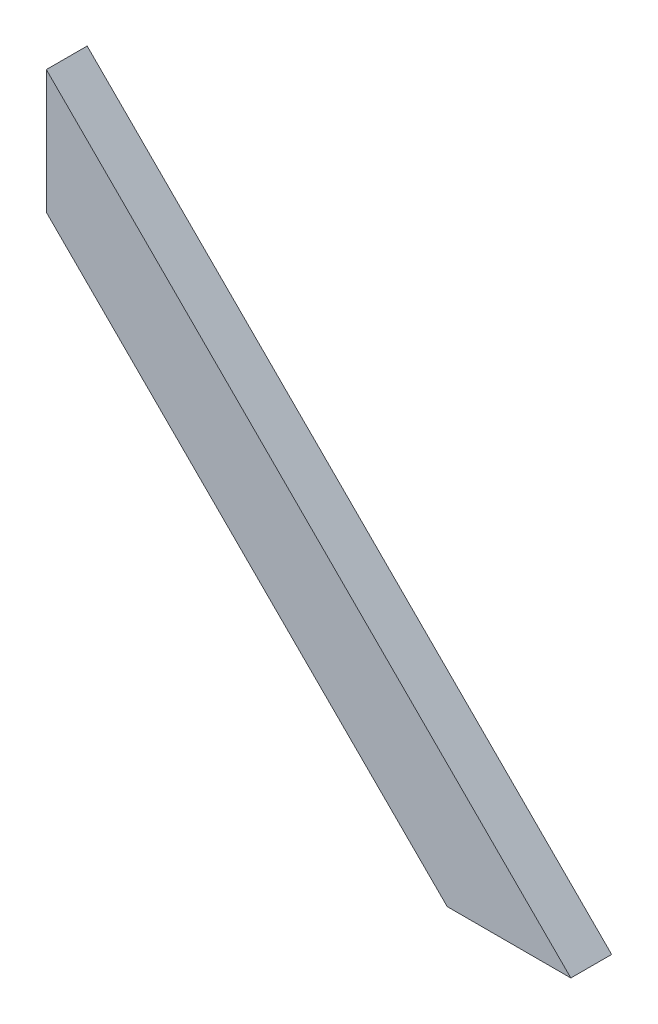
ISO-10303-21;
HEADER;
FILE_DESCRIPTION(('STEP AP214'),'2;1');
FILE_NAME('part.step','',(''),(''),'','','');
FILE_SCHEMA(('AUTOMOTIVE_DESIGN { 1 0 10303 214 1 1 1 1 }'));
ENDSEC;
DATA;
#1=APPLICATION_CONTEXT('core data for automotive mechanical design processes');
#2=APPLICATION_PROTOCOL_DEFINITION('international standard','automotive_design',2000,#1);
#3=PRODUCT_CONTEXT('',#1,'mechanical');
#4=PRODUCT('Part','Part','',(#3));
#5=PRODUCT_RELATED_PRODUCT_CATEGORY('part','',(#4));
#6=PRODUCT_DEFINITION_FORMATION('','',#4);
#7=PRODUCT_DEFINITION_CONTEXT('part definition',#1,'design');
#8=PRODUCT_DEFINITION('design','',#6,#7);
#9=PRODUCT_DEFINITION_SHAPE('','',#8);
#10=(LENGTH_UNIT() NAMED_UNIT(*) SI_UNIT(.MILLI.,.METRE.));
#11=(NAMED_UNIT(*) PLANE_ANGLE_UNIT() SI_UNIT($,.RADIAN.));
#12=(NAMED_UNIT(*) SI_UNIT($,.STERADIAN.) SOLID_ANGLE_UNIT());
#13=UNCERTAINTY_MEASURE_WITH_UNIT(LENGTH_MEASURE(1.E-05),#10,'distance_accuracy_value','');
#14=(GEOMETRIC_REPRESENTATION_CONTEXT(3) GLOBAL_UNCERTAINTY_ASSIGNED_CONTEXT((#13)) GLOBAL_UNIT_ASSIGNED_CONTEXT((#10,
#11,#12)) REPRESENTATION_CONTEXT('',''));
#15=CARTESIAN_POINT('',(0.,0.,0.));
#16=DIRECTION('',(0.,0.,1.));
#17=DIRECTION('',(1.,0.,0.));
#18=AXIS2_PLACEMENT_3D('',#15,#16,#17);
#19=CARTESIAN_POINT('',(426.863096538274,554.422308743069,15.24));
#20=DIRECTION('',(0.,0.,-1.));
#21=DIRECTION('',(-1.,0.,0.));
#22=AXIS2_PLACEMENT_3D('',#19,#20,#21);
#23=PLANE('',#22);
#24=CARTESIAN_POINT('',(426.863096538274,554.422308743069,15.24));
#25=DIRECTION('',(0.,0.,-1.));
#26=DIRECTION('',(-1.,0.,0.));
#27=AXIS2_PLACEMENT_3D('',#24,#25,#26);
#28=CIRCLE('',#27,1.26999999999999);
#29=CARTESIAN_POINT('',(425.593096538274,554.422308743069,15.24));
#30=VERTEX_POINT('',#29);
#31=EDGE_CURVE('E20',#30,#30,#28,.T.);
#32=ORIENTED_EDGE('',*,*,#31,.T.);
#33=EDGE_LOOP('',(#32));
#34=FACE_BOUND('',#33,.T.);
#35=ADVANCED_FACE('F17',(#34),#23,.T.);
#36=CARTESIAN_POINT('',(433.88629523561,537.948679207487,12.7));
#37=DIRECTION('',(0.,0.,1.));
#38=DIRECTION('',(1.,0.,0.));
#39=AXIS2_PLACEMENT_3D('',#36,#37,#38);
#40=PLANE('',#39);
#41=CARTESIAN_POINT('',(433.88629523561,537.948679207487,12.7));
#42=DIRECTION('',(0.,0.,-1.));
#43=DIRECTION('',(-1.,0.,0.));
#44=AXIS2_PLACEMENT_3D('',#41,#42,#43);
#45=CIRCLE('',#44,1.26999999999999);
#46=CARTESIAN_POINT('',(432.61629523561,537.948679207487,12.7));
#47=VERTEX_POINT('',#46);
#48=EDGE_CURVE('E136',#47,#47,#45,.T.);
#49=ORIENTED_EDGE('',*,*,#48,.T.);
#50=EDGE_LOOP('',(#49));
#51=FACE_BOUND('',#50,.T.);
#52=ADVANCED_FACE('F203',(#51),#40,.F.);
#53=CARTESIAN_POINT('',(515.559069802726,456.27590464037,12.7));
#54=DIRECTION('',(0.,0.,1.));
#55=DIRECTION('',(1.,0.,0.));
#56=AXIS2_PLACEMENT_3D('',#53,#54,#55);
#57=PLANE('',#56);
#58=CARTESIAN_POINT('',(515.559069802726,456.27590464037,12.7));
#59=DIRECTION('',(0.,0.,-1.));
#60=DIRECTION('',(-1.,0.,0.));
#61=AXIS2_PLACEMENT_3D('',#58,#59,#60);
#62=CIRCLE('',#61,1.26999999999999);
#63=CARTESIAN_POINT('',(514.289069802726,456.27590464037,12.7));
#64=VERTEX_POINT('',#63);
#65=EDGE_CURVE('E134',#64,#64,#62,.T.);
#66=ORIENTED_EDGE('',*,*,#65,.T.);
#67=EDGE_LOOP('',(#66));
#68=FACE_BOUND('',#67,.T.);
#69=ADVANCED_FACE('F158',(#68),#57,.F.);
#70=CARTESIAN_POINT('',(592.236510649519,379.598463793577,12.7));
#71=DIRECTION('',(0.,0.,1.));
#72=DIRECTION('',(1.,0.,0.));
#73=AXIS2_PLACEMENT_3D('',#70,#71,#72);
#74=PLANE('',#73);
#75=CARTESIAN_POINT('',(592.236510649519,379.598463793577,12.7));
#76=DIRECTION('',(0.,0.,-1.));
#77=DIRECTION('',(-1.,0.,0.));
#78=AXIS2_PLACEMENT_3D('',#75,#76,#77);
#79=CIRCLE('',#78,1.26999999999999);
#80=CARTESIAN_POINT('',(590.966510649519,379.598463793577,12.7));
#81=VERTEX_POINT('',#80);
#82=EDGE_CURVE('E78',#81,#81,#79,.T.);
#83=ORIENTED_EDGE('',*,*,#82,.T.);
#84=EDGE_LOOP('',(#83));
#85=FACE_BOUND('',#84,.T.);
#86=ADVANCED_FACE('F147',(#85),#74,.F.);
#87=CARTESIAN_POINT('',(426.863096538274,554.422308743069,15.24));
#88=DIRECTION('',(0.,0.,-1.));
#89=DIRECTION('',(-1.,0.,0.));
#90=AXIS2_PLACEMENT_3D('',#87,#88,#89);
#91=CYLINDRICAL_SURFACE('',#90,1.26999999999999);
#92=CARTESIAN_POINT('',(426.863096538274,554.422308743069,6.096));
#93=DIRECTION('',(0.,0.,-1.));
#94=DIRECTION('',(-1.,0.,0.));
#95=AXIS2_PLACEMENT_3D('',#92,#93,#94);
#96=CIRCLE('',#95,1.26999999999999);
#97=CARTESIAN_POINT('',(425.593096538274,554.422308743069,6.096));
#98=VERTEX_POINT('',#97);
#99=EDGE_CURVE('E77',#98,#98,#96,.T.);
#100=ORIENTED_EDGE('',*,*,#99,.T.);
#101=EDGE_LOOP('',(#100));
#102=FACE_BOUND('',#101,.T.);
#103=ORIENTED_EDGE('',*,*,#31,.F.);
#104=EDGE_LOOP('',(#103));
#105=FACE_BOUND('',#104,.T.);
#106=ADVANCED_FACE('F144',(#102,#105),#91,.F.);
#107=CARTESIAN_POINT('',(433.88629523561,537.948679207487,12.7));
#108=DIRECTION('',(0.,0.,-1.));
#109=DIRECTION('',(-1.,0.,0.));
#110=AXIS2_PLACEMENT_3D('',#107,#108,#109);
#111=CYLINDRICAL_SURFACE('',#110,1.26999999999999);
#112=CARTESIAN_POINT('',(433.88629523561,537.948679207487,6.096));
#113=DIRECTION('',(0.,0.,-1.));
#114=DIRECTION('',(-1.,0.,0.));
#115=AXIS2_PLACEMENT_3D('',#112,#113,#114);
#116=CIRCLE('',#115,1.26999999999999);
#117=CARTESIAN_POINT('',(432.61629523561,537.948679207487,6.096));
#118=VERTEX_POINT('',#117);
#119=EDGE_CURVE('E127',#118,#118,#116,.T.);
#120=ORIENTED_EDGE('',*,*,#119,.T.);
#121=EDGE_LOOP('',(#120));
#122=FACE_BOUND('',#121,.T.);
#123=ORIENTED_EDGE('',*,*,#48,.F.);
#124=EDGE_LOOP('',(#123));
#125=FACE_BOUND('',#124,.T.);
#126=ADVANCED_FACE('F146',(#122,#125),#111,.F.);
#127=CARTESIAN_POINT('',(515.559069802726,456.27590464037,12.7));
#128=DIRECTION('',(0.,0.,-1.));
#129=DIRECTION('',(-1.,0.,0.));
#130=AXIS2_PLACEMENT_3D('',#127,#128,#129);
#131=CYLINDRICAL_SURFACE('',#130,1.26999999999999);
#132=CARTESIAN_POINT('',(515.559069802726,456.27590464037,6.096));
#133=DIRECTION('',(0.,0.,-1.));
#134=DIRECTION('',(-1.,0.,0.));
#135=AXIS2_PLACEMENT_3D('',#132,#133,#134);
#136=CIRCLE('',#135,1.26999999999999);
#137=CARTESIAN_POINT('',(514.289069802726,456.27590464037,6.096));
#138=VERTEX_POINT('',#137);
#139=EDGE_CURVE('E124',#138,#138,#136,.T.);
#140=ORIENTED_EDGE('',*,*,#139,.T.);
#141=EDGE_LOOP('',(#140));
#142=FACE_BOUND('',#141,.T.);
#143=ORIENTED_EDGE('',*,*,#65,.F.);
#144=EDGE_LOOP('',(#143));
#145=FACE_BOUND('',#144,.T.);
#146=ADVANCED_FACE('F155',(#142,#145),#131,.F.);
#147=CARTESIAN_POINT('',(592.236510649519,379.598463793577,12.7));
#148=DIRECTION('',(0.,0.,-1.));
#149=DIRECTION('',(-1.,0.,0.));
#150=AXIS2_PLACEMENT_3D('',#147,#148,#149);
#151=CYLINDRICAL_SURFACE('',#150,1.26999999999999);
#152=CARTESIAN_POINT('',(592.236510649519,379.598463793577,6.096));
#153=DIRECTION('',(0.,0.,-1.));
#154=DIRECTION('',(-1.,0.,0.));
#155=AXIS2_PLACEMENT_3D('',#152,#153,#154);
#156=CIRCLE('',#155,1.26999999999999);
#157=CARTESIAN_POINT('',(590.966510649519,379.598463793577,6.096));
#158=VERTEX_POINT('',#157);
#159=EDGE_CURVE('E93',#158,#158,#156,.T.);
#160=ORIENTED_EDGE('',*,*,#159,.T.);
#161=EDGE_LOOP('',(#160));
#162=FACE_BOUND('',#161,.T.);
#163=ORIENTED_EDGE('',*,*,#82,.F.);
#164=EDGE_LOOP('',(#163));
#165=FACE_BOUND('',#164,.T.);
#166=ADVANCED_FACE('F190',(#162,#165),#151,.F.);
#167=CARTESIAN_POINT('',(412.03537714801,569.250028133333,15.24));
#168=DIRECTION('',(0.,0.,-1.));
#169=DIRECTION('',(-1.,0.,0.));
#170=AXIS2_PLACEMENT_3D('',#167,#168,#169);
#171=CYLINDRICAL_SURFACE('',#170,1.26999999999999);
#172=DIRECTION('',(0.,0.,-1.));
#173=VECTOR('',#172,1.);
#174=CARTESIAN_POINT('',(412.03537714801,570.520028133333,23.876));
#175=LINE('',#174,#173);
#176=CARTESIAN_POINT('',(412.03537714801,570.520028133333,15.24));
#177=VERTEX_POINT('',#176);
#178=CARTESIAN_POINT('',(412.03537714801,570.520028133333,6.096));
#179=VERTEX_POINT('',#178);
#180=EDGE_CURVE('E71',#177,#179,#175,.T.);
#181=ORIENTED_EDGE('',*,*,#180,.T.);
#182=CARTESIAN_POINT('',(412.03537714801,569.250028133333,6.096));
#183=DIRECTION('',(0.,0.,-1.));
#184=DIRECTION('',(-1.,0.,0.));
#185=AXIS2_PLACEMENT_3D('',#182,#183,#184);
#186=CIRCLE('',#185,1.26999999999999);
#187=CARTESIAN_POINT('',(412.03537714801,567.980028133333,6.096));
#188=VERTEX_POINT('',#187);
#189=EDGE_CURVE('E89',#179,#188,#186,.T.);
#190=ORIENTED_EDGE('',*,*,#189,.T.);
#191=DIRECTION('',(0.,0.,-1.));
#192=VECTOR('',#191,1.);
#193=CARTESIAN_POINT('',(412.03537714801,567.980028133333,23.876));
#194=LINE('',#193,#192);
#195=CARTESIAN_POINT('',(412.03537714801,567.980028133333,15.24));
#196=VERTEX_POINT('',#195);
#197=EDGE_CURVE('E74',#188,#196,#194,.F.);
#198=ORIENTED_EDGE('',*,*,#197,.T.);
#199=CARTESIAN_POINT('',(412.03537714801,569.250028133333,15.24));
#200=DIRECTION('',(0.,0.,-1.));
#201=DIRECTION('',(-1.,0.,0.));
#202=AXIS2_PLACEMENT_3D('',#199,#200,#201);
#203=CIRCLE('',#202,1.26999999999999);
#204=EDGE_CURVE('E67',#177,#196,#203,.T.);
#205=ORIENTED_EDGE('',*,*,#204,.F.);
#206=EDGE_LOOP('',(#181,#190,#198,#205));
#207=FACE_BOUND('',#206,.T.);
#208=ADVANCED_FACE('F69',(#207),#171,.F.);
#209=CARTESIAN_POINT('',(412.03537714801,569.250028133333,15.24));
#210=DIRECTION('',(0.,0.,-1.));
#211=DIRECTION('',(-1.,0.,0.));
#212=AXIS2_PLACEMENT_3D('',#209,#210,#211);
#213=PLANE('',#212);
#214=DIRECTION('',(0.,1.,0.));
#215=VECTOR('',#214,1.);
#216=CARTESIAN_POINT('',(412.03537714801,0.,15.24));
#217=LINE('',#216,#215);
#218=EDGE_CURVE('E80',#196,#177,#217,.T.);
#219=ORIENTED_EDGE('',*,*,#218,.T.);
#220=ORIENTED_EDGE('',*,*,#204,.T.);
#221=EDGE_LOOP('',(#219,#220));
#222=FACE_BOUND('',#221,.T.);
#223=ADVANCED_FACE('F81',(#222),#213,.T.);
#224=CARTESIAN_POINT('',(0.,0.,6.096));
#225=DIRECTION('',(0.,0.,1.));
#226=DIRECTION('',(1.,0.,0.));
#227=AXIS2_PLACEMENT_3D('',#224,#225,#226);
#228=PLANE('',#227);
#229=ORIENTED_EDGE('',*,*,#189,.F.);
#230=DIRECTION('',(0.,1.,0.));
#231=VECTOR('',#230,1.);
#232=CARTESIAN_POINT('',(412.03537714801,0.,6.096));
#233=LINE('',#232,#231);
#234=CARTESIAN_POINT('',(412.03537714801,581.352211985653,6.096));
#235=VERTEX_POINT('',#234);
#236=EDGE_CURVE('E88',#179,#235,#233,.T.);
#237=ORIENTED_EDGE('',*,*,#236,.T.);
#238=DIRECTION('',(0.707106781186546,-0.707106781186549,0.));
#239=VECTOR('',#238,1.);
#240=CARTESIAN_POINT('',(496.693794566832,496.69379456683,6.096));
#241=LINE('',#240,#239);
#242=CARTESIAN_POINT('',(640.635377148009,352.752211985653,6.096));
#243=VERTEX_POINT('',#242);
#244=EDGE_CURVE('E114',#235,#243,#241,.T.);
#245=ORIENTED_EDGE('',*,*,#244,.T.);
#246=DIRECTION('',(1.,0.,0.));
#247=VECTOR('',#246,1.);
#248=CARTESIAN_POINT('',(0.,352.752211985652,6.096));
#249=LINE('',#248,#247);
#250=CARTESIAN_POINT('',(586.753840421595,352.752211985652,6.096));
#251=VERTEX_POINT('',#250);
#252=EDGE_CURVE('E104',#251,#243,#249,.T.);
#253=ORIENTED_EDGE('',*,*,#252,.F.);
#254=DIRECTION('',(-0.707106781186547,0.707106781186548,0.));
#255=VECTOR('',#254,1.);
#256=CARTESIAN_POINT('',(469.753026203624,469.753026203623,6.096));
#257=LINE('',#256,#255);
#258=CARTESIAN_POINT('',(412.03537714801,527.470675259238,6.096));
#259=VERTEX_POINT('',#258);
#260=EDGE_CURVE('E101',#251,#259,#257,.T.);
#261=ORIENTED_EDGE('',*,*,#260,.T.);
#262=DIRECTION('',(0.,1.,0.));
#263=VECTOR('',#262,1.);
#264=CARTESIAN_POINT('',(412.03537714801,0.,6.096));
#265=LINE('',#264,#263);
#266=EDGE_CURVE('E91',#259,#188,#265,.T.);
#267=ORIENTED_EDGE('',*,*,#266,.T.);
#268=EDGE_LOOP('',(#229,#237,#245,#253,#261,#267));
#269=FACE_BOUND('',#268,.T.);
#270=ORIENTED_EDGE('',*,*,#159,.F.);
#271=EDGE_LOOP('',(#270));
#272=FACE_BOUND('',#271,.T.);
#273=ORIENTED_EDGE('',*,*,#139,.F.);
#274=EDGE_LOOP('',(#273));
#275=FACE_BOUND('',#274,.T.);
#276=ORIENTED_EDGE('',*,*,#119,.F.);
#277=EDGE_LOOP('',(#276));
#278=FACE_BOUND('',#277,.T.);
#279=ORIENTED_EDGE('',*,*,#99,.F.);
#280=EDGE_LOOP('',(#279));
#281=FACE_BOUND('',#280,.T.);
#282=ADVANCED_FACE('F182',(#269,#272,#275,#278,#281),#228,.F.);
#283=CARTESIAN_POINT('',(412.03537714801,0.,23.876));
#284=DIRECTION('',(1.,0.,0.));
#285=DIRECTION('',(0.,0.,-1.));
#286=AXIS2_PLACEMENT_3D('',#283,#284,#285);
#287=PLANE('',#286);
#288=ORIENTED_EDGE('',*,*,#197,.F.);
#289=ORIENTED_EDGE('',*,*,#266,.F.);
#290=DIRECTION('',(0.,0.,1.));
#291=VECTOR('',#290,1.);
#292=CARTESIAN_POINT('',(412.03537714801,527.470675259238,23.876));
#293=LINE('',#292,#291);
#294=CARTESIAN_POINT('',(412.03537714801,527.470675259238,23.876));
#295=VERTEX_POINT('',#294);
#296=EDGE_CURVE('E83',#259,#295,#293,.T.);
#297=ORIENTED_EDGE('',*,*,#296,.T.);
#298=DIRECTION('',(0.,1.,0.));
#299=VECTOR('',#298,1.);
#300=CARTESIAN_POINT('',(412.03537714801,0.,23.876));
#301=LINE('',#300,#299);
#302=CARTESIAN_POINT('',(412.03537714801,581.352211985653,23.876));
#303=VERTEX_POINT('',#302);
#304=EDGE_CURVE('E119',#303,#295,#301,.F.);
#305=ORIENTED_EDGE('',*,*,#304,.F.);
#306=DIRECTION('',(0.,0.,1.));
#307=VECTOR('',#306,1.);
#308=CARTESIAN_POINT('',(412.03537714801,581.352211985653,23.876));
#309=LINE('',#308,#307);
#310=EDGE_CURVE('E112',#303,#235,#309,.F.);
#311=ORIENTED_EDGE('',*,*,#310,.T.);
#312=ORIENTED_EDGE('',*,*,#236,.F.);
#313=ORIENTED_EDGE('',*,*,#180,.F.);
#314=ORIENTED_EDGE('',*,*,#218,.F.);
#315=EDGE_LOOP('',(#288,#289,#297,#305,#311,#312,#313,#314));
#316=FACE_BOUND('',#315,.T.);
#317=ADVANCED_FACE('F86',(#316),#287,.F.);
#318=CARTESIAN_POINT('',(469.753026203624,469.753026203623,23.876));
#319=DIRECTION('',(0.707106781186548,0.707106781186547,0.));
#320=DIRECTION('',(-0.707106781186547,0.707106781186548,0.));
#321=AXIS2_PLACEMENT_3D('',#318,#319,#320);
#322=PLANE('',#321);
#323=DIRECTION('',(0.,0.,-1.));
#324=VECTOR('',#323,1.);
#325=CARTESIAN_POINT('',(586.753840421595,352.752211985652,23.876));
#326=LINE('',#325,#324);
#327=CARTESIAN_POINT('',(586.753840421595,352.752211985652,23.876));
#328=VERTEX_POINT('',#327);
#329=EDGE_CURVE('E284',#328,#251,#326,.T.);
#330=ORIENTED_EDGE('',*,*,#329,.F.);
#331=DIRECTION('',(0.707106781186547,-0.707106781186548,0.));
#332=VECTOR('',#331,1.);
#333=CARTESIAN_POINT('',(412.03537714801,527.470675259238,23.876));
#334=LINE('',#333,#332);
#335=EDGE_CURVE('E290',#295,#328,#334,.T.);
#336=ORIENTED_EDGE('',*,*,#335,.F.);
#337=ORIENTED_EDGE('',*,*,#296,.F.);
#338=ORIENTED_EDGE('',*,*,#260,.F.);
#339=EDGE_LOOP('',(#330,#336,#337,#338));
#340=FACE_BOUND('',#339,.T.);
#341=ADVANCED_FACE('F176',(#340),#322,.F.);
#342=CARTESIAN_POINT('',(0.,352.752211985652,23.876));
#343=DIRECTION('',(0.,-1.,0.));
#344=DIRECTION('',(0.,0.,-1.));
#345=AXIS2_PLACEMENT_3D('',#342,#343,#344);
#346=PLANE('',#345);
#347=DIRECTION('',(1.,0.,0.));
#348=VECTOR('',#347,1.);
#349=CARTESIAN_POINT('',(0.,352.752211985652,23.876));
#350=LINE('',#349,#348);
#351=CARTESIAN_POINT('',(640.635377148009,352.752211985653,23.876));
#352=VERTEX_POINT('',#351);
#353=EDGE_CURVE('E26',#328,#352,#350,.T.);
#354=ORIENTED_EDGE('',*,*,#353,.F.);
#355=ORIENTED_EDGE('',*,*,#329,.T.);
#356=ORIENTED_EDGE('',*,*,#252,.T.);
#357=DIRECTION('',(0.,0.,1.));
#358=VECTOR('',#357,1.);
#359=CARTESIAN_POINT('',(640.635377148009,352.752211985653,23.876));
#360=LINE('',#359,#358);
#361=EDGE_CURVE('E35',#243,#352,#360,.T.);
#362=ORIENTED_EDGE('',*,*,#361,.T.);
#363=EDGE_LOOP('',(#354,#355,#356,#362));
#364=FACE_BOUND('',#363,.T.);
#365=ADVANCED_FACE('F169',(#364),#346,.T.);
#366=CARTESIAN_POINT('',(496.693794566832,496.69379456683,23.876));
#367=DIRECTION('',(-0.707106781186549,-0.707106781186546,0.));
#368=DIRECTION('',(0.707106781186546,-0.707106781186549,0.));
#369=AXIS2_PLACEMENT_3D('',#366,#367,#368);
#370=PLANE('',#369);
#371=ORIENTED_EDGE('',*,*,#310,.F.);
#372=DIRECTION('',(-0.707106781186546,0.707106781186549,0.));
#373=VECTOR('',#372,1.);
#374=CARTESIAN_POINT('',(640.635377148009,352.752211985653,23.876));
#375=LINE('',#374,#373);
#376=EDGE_CURVE('E11',#352,#303,#375,.T.);
#377=ORIENTED_EDGE('',*,*,#376,.F.);
#378=ORIENTED_EDGE('',*,*,#361,.F.);
#379=ORIENTED_EDGE('',*,*,#244,.F.);
#380=EDGE_LOOP('',(#371,#377,#378,#379));
#381=FACE_BOUND('',#380,.T.);
#382=ADVANCED_FACE('F163',(#381),#370,.F.);
#383=CARTESIAN_POINT('',(0.,0.,23.876));
#384=DIRECTION('',(0.,0.,1.));
#385=DIRECTION('',(1.,0.,0.));
#386=AXIS2_PLACEMENT_3D('',#383,#384,#385);
#387=PLANE('',#386);
#388=ORIENTED_EDGE('',*,*,#353,.T.);
#389=ORIENTED_EDGE('',*,*,#376,.T.);
#390=ORIENTED_EDGE('',*,*,#304,.T.);
#391=ORIENTED_EDGE('',*,*,#335,.T.);
#392=EDGE_LOOP('',(#388,#389,#390,#391));
#393=FACE_BOUND('',#392,.T.);
#394=ADVANCED_FACE('F161',(#393),#387,.T.);
#395=CLOSED_SHELL('',(#35,#52,#69,#86,#106,#126,#146,#166,#208,#223,#282,#317,#341,#365,#382,#394));
#396=MANIFOLD_SOLID_BREP('B1',#395);
#397=ADVANCED_BREP_SHAPE_REPRESENTATION('',(#18,#396),#14);
#398=SHAPE_DEFINITION_REPRESENTATION(#9,#397);
ENDSEC;
END-ISO-10303-21;
